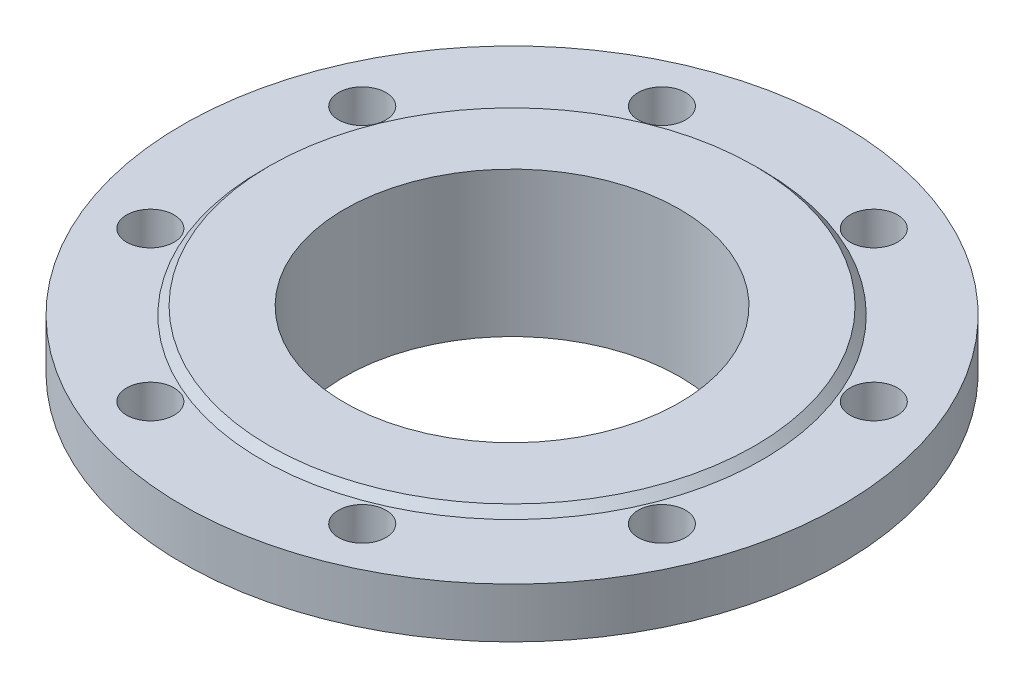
from build123d import *

# Parameters (mm, degrees)
ESQUISSE2_R             = 9
ENL_V_MAT_EXTRU_1_DEPTH = 543.175248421


with BuildPart() as part:
    # Esquisse1 → R_volution1 (revolve)
    with BuildSketch(Plane.XY, mode=Mode.PRIVATE) as r_volution1_sk:
        Polygon((-330.15, 375), (-330.15, 387), (-321, 408), (-275, 408), (-275, 427), (-305, 427), (-308, 430), (-336.45, 430), (-336.45, 375), align=None)
    revolve(r_volution1_sk.sketch.rotate(Axis((-400, 375, 0), (0, 1, 0)), 90), axis=Axis((-400, 375, 0), (0, 1, 0)))

    # Esquisse2 → Enl_v. mat.-Extru.1 (cut, through all)
    with BuildSketch(Plane(origin=(0, 427, 0), x_dir=(1, 0, 0), z_dir=(0, 1, 0))):
        with Locations(Location((-302.992649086, 40.181760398, 0), (0, 0, 270))):
            Circle(ESQUISSE2_R)
        with Locations(Location((-302.992649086, -40.181760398, 0), (0, 0, 270))):
            Circle(ESQUISSE2_R)
        with Locations(Location((-359.818239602, -97.007350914, 0), (0, 0, 270))):
            Circle(ESQUISSE2_R)
        with Locations(Location((-440.181760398, -97.007350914, 0), (0, 0, 270))):
            Circle(ESQUISSE2_R)
        with Locations(Location((-497.007350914, -40.181760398, 0), (0, 0, 270))):
            Circle(ESQUISSE2_R)
        with Locations(Location((-497.007350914, 40.181760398, 0), (0, 0, 270))):
            Circle(ESQUISSE2_R)
        with Locations(Location((-440.181760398, 97.007350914, 0), (0, 0, 270))):
            Circle(ESQUISSE2_R)
        with Locations(Location((-359.818239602, 97.007350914, 0), (0, 0, 270))):
            Circle(ESQUISSE2_R)
    extrude(amount=-ENL_V_MAT_EXTRU_1_DEPTH, mode=Mode.SUBTRACT)


solid = part.part
